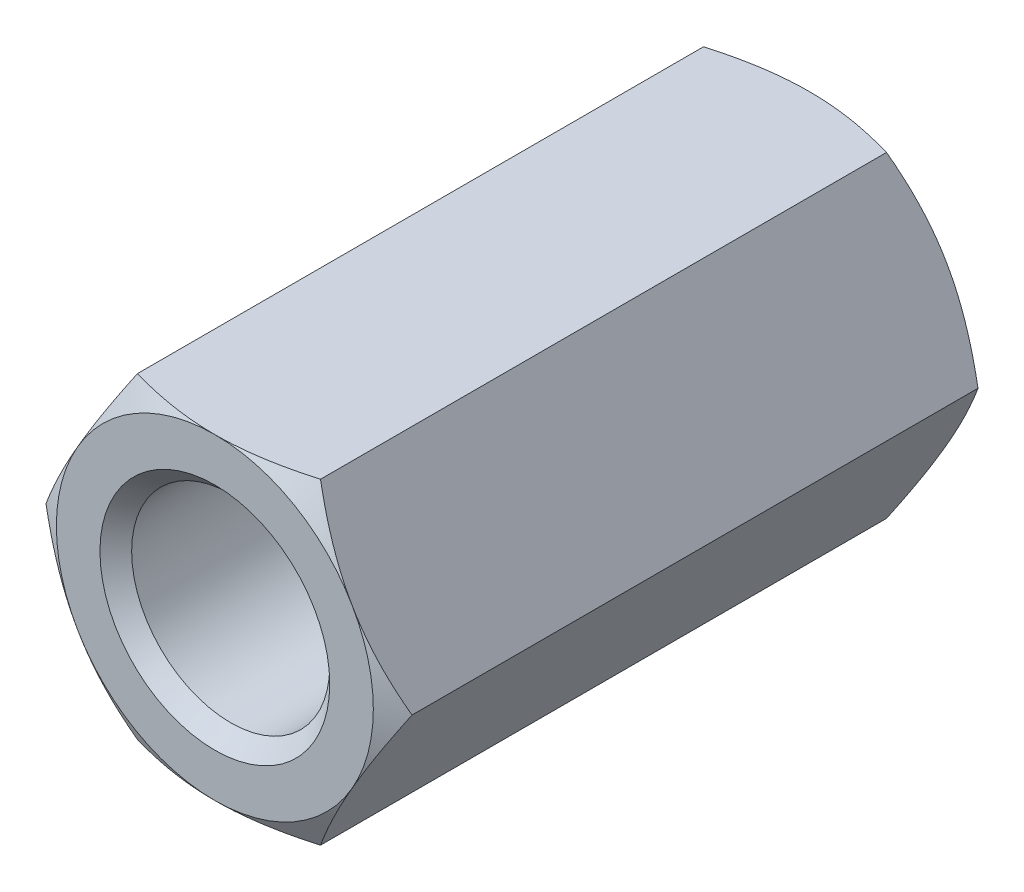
from build123d import *

# Parameters (mm, degrees)
BOSS_EXTRUDE1_DEPTH      = 7.5
SKETCH2_OUTSIDE_W        = 51.08
SKETCH2_OUTSIDE_H        = 49.842
SKETCH2_OUTSIDE_R        = 4
CUT_EXTRUDE1_DEPTH       = 10.673847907
CUT_EXTRUDE1_DRAFT       = -60
SKETCH3_R                = 2.5
SKETCH3_R_2              = 2.1
CUT_EXTRUDE2_DEPTH       = 7.5
SKETCH3_2_R              = 2.1
CUT_EXTRUDE3_DEPTH       = 8.7
CHAMFER1_SIZE            = 0.4
MIRROR1_COPY_1_SKETCH_W  = 51.08
MIRROR1_COPY_1_SKETCH_H  = 49.842
MIRROR1_COPY_1_SKETCH_R  = 4
MIRROR1_COPY_1_DEPTH     = 10.673847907
MIRROR1_COPY_1_DRAFT     = -60
CHAMFER1_OF_MIRROR1_SIZE = 0.4


with BuildPart() as part:
    # Sketch1 → Boss-Extrude1 (new body)
    with BuildSketch(Plane.XY):
        Polygon((2.309401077, 4), (-2.309401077, 4), (-4.618802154, 0), (-2.309401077, -4), (2.309401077, -4), (4.618802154, 0), align=None)
    boss_extrude1 = extrude(amount=-BOSS_EXTRUDE1_DEPTH)


with BuildPart() as cut_extrude1_tool:
    # Sketch2 outside → Cut-Extrude1 (with draft: the straight prism first)
    with BuildSketch(Plane(origin=(0, 0, -7.5), x_dir=(-1, 0, 0), z_dir=(0, 0, -1))):
        Rectangle(SKETCH2_OUTSIDE_W, SKETCH2_OUTSIDE_H)
        Circle(SKETCH2_OUTSIDE_R, mode=Mode.SUBTRACT)
    extrude(amount=-CUT_EXTRUDE1_DEPTH)
    # Cut-Extrude1: the draft: its side faces are tilted about the plane it starts from
    cut_extrude1_sides = [cut_extrude1_tool.faces().sort_by_distance(p)[0] for p in [
        (0, -24.921, -2.163076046),
        (-25.54, 0, -2.163076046),
        (0, 24.921, -2.163076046),
        (25.54, 0, -2.163076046),
        (4, 0, -2.163076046),
    ]]
    draft(cut_extrude1_sides, Plane(origin=(0, 0, -7.5), x_dir=(-1, 0, 0), z_dir=(0, 0, -1)), CUT_EXTRUDE1_DRAFT)


with BuildPart() as part_1:
    add(part.part)

    # Cut-Extrude1: cut by cut_extrude1_tool
    add(cut_extrude1_tool.part, mode=Mode.SUBTRACT)

    # Sketch3 → Cut-Extrude2 (cut)
    with BuildSketch(Plane(origin=(0, 0, -7.5), x_dir=(-1, 0, 0), z_dir=(0, 0, -1))):
        Circle(SKETCH3_R)
        Circle(SKETCH3_R_2, mode=Mode.SUBTRACT)
    cut_extrude2 = extrude(amount=-CUT_EXTRUDE2_DEPTH, mode=Mode.SUBTRACT)


with BuildPart() as cut_extrude2_piece_1:
    # of the separate pieces the step leaves, piece 1, a body of its own (cut_extrude2_pieces)
    add(part_1.part.solids().sort_by_distance((2.309401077, 4, 0))[0])

    # Chamfer1
    chamfer1_edges = [cut_extrude2_piece_1.edges().sort_by_distance(p)[0] for p in [
        (2.5, 0, -7.5),
    ]]
    chamfer(chamfer1_edges, length=CHAMFER1_SIZE)


with BuildPart() as cut_extrude2_piece_2:
    # of the separate pieces the step leaves, piece 2, a body of its own (cut_extrude2_pieces)
    add(part_1.part.solids().sort_by_distance((-2.1, 0, 0))[0])

    # Sketch3_2 → Cut-Extrude3 (cut)
    with BuildSketch(Plane(origin=(0, 0, -7.5), x_dir=(-1, 0, 0), z_dir=(0, 0, -1))):
        Circle(SKETCH3_2_R)
    cut_extrude3 = extrude(amount=-CUT_EXTRUDE3_DEPTH, mode=Mode.SUBTRACT)


with BuildPart() as cut_extrude2_piece_1_1:
    add(cut_extrude2_piece_1.part)

    # Mirror1: Boss-Extrude1, Cut-Extrude2, Cut-Extrude3 across plane
    add(boss_extrude1.mirror(Plane.XY))
    add(cut_extrude2.mirror(Plane.XY), mode=Mode.SUBTRACT)
    add(cut_extrude3.mirror(Plane.XY), mode=Mode.SUBTRACT)


with BuildPart() as mirror1_copy_1_tool:
    # Mirror1 copy 1 sketch → Mirror1 copy 1 (with draft: the straight prism first)
    with BuildSketch(Plane(origin=(0, 0, 7.5), x_dir=(-1, 0, 0), z_dir=(0, 0, 1))):
        Rectangle(MIRROR1_COPY_1_SKETCH_W, MIRROR1_COPY_1_SKETCH_H)
        Circle(MIRROR1_COPY_1_SKETCH_R, mode=Mode.SUBTRACT)
    extrude(amount=-MIRROR1_COPY_1_DEPTH)
    # Mirror1 copy 1: the draft: its side faces are tilted about the plane it starts from
    mirror1_copy_1_sides = [mirror1_copy_1_tool.faces().sort_by_distance(p)[0] for p in [
        (0, -24.921, 2.163076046),
        (-25.54, 0, 2.163076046),
        (0, 24.921, 2.163076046),
        (25.54, 0, 2.163076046),
        (4, 0, 2.163076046),
    ]]
    draft(mirror1_copy_1_sides, Plane(origin=(0, 0, 7.5), x_dir=(-1, 0, 0), z_dir=(0, 0, 1)), MIRROR1_COPY_1_DRAFT)


with BuildPart() as cut_extrude2_piece_1_2:
    add(cut_extrude2_piece_1_1.part)

    # Mirror1 copy 1: cut by mirror1_copy_1_tool
    add(mirror1_copy_1_tool.part, mode=Mode.SUBTRACT)

    # Chamfer1 of Mirror1
    chamfer1_of_mirror1_edges = [cut_extrude2_piece_1_2.edges().sort_by_distance(p)[0] for p in [
        (2.5, 0, 7.5),
    ]]
    chamfer(chamfer1_of_mirror1_edges, length=CHAMFER1_OF_MIRROR1_SIZE)


solid = cut_extrude2_piece_1_2.part
